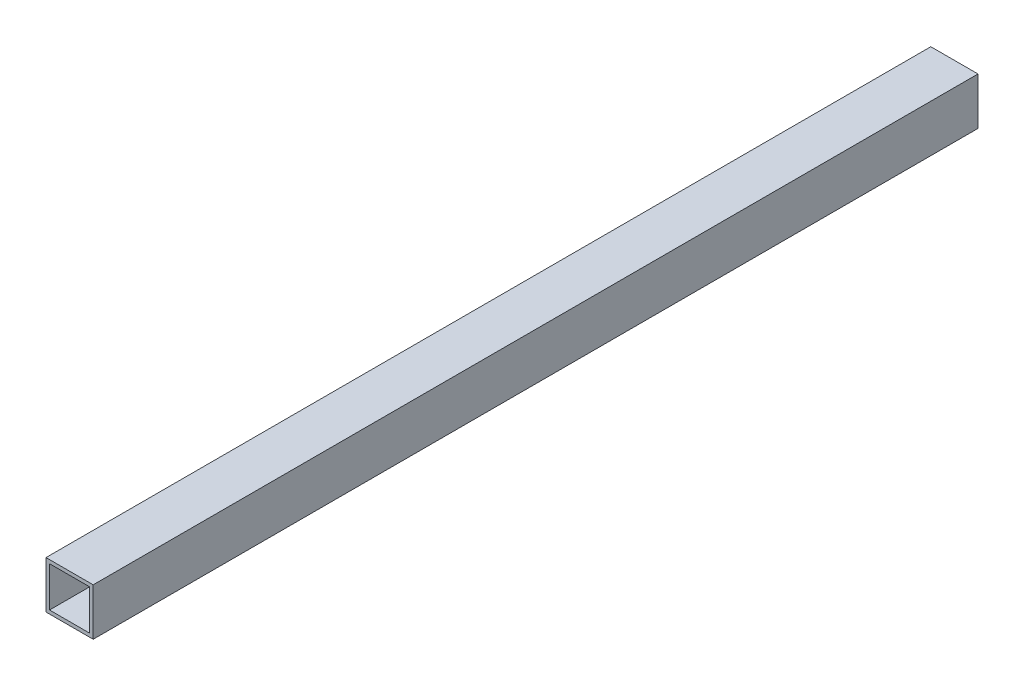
ISO-10303-21;
HEADER;
FILE_DESCRIPTION(('STEP AP214'),'2;1');
FILE_NAME('part.step','',(''),(''),'','','');
FILE_SCHEMA(('AUTOMOTIVE_DESIGN { 1 0 10303 214 1 1 1 1 }'));
ENDSEC;
DATA;
#1=APPLICATION_CONTEXT('core data for automotive mechanical design processes');
#2=APPLICATION_PROTOCOL_DEFINITION('international standard','automotive_design',2000,#1);
#3=PRODUCT_CONTEXT('',#1,'mechanical');
#4=PRODUCT('Part','Part','',(#3));
#5=PRODUCT_RELATED_PRODUCT_CATEGORY('part','',(#4));
#6=PRODUCT_DEFINITION_FORMATION('','',#4);
#7=PRODUCT_DEFINITION_CONTEXT('part definition',#1,'design');
#8=PRODUCT_DEFINITION('design','',#6,#7);
#9=PRODUCT_DEFINITION_SHAPE('','',#8);
#10=(LENGTH_UNIT() NAMED_UNIT(*) SI_UNIT(.MILLI.,.METRE.));
#11=(NAMED_UNIT(*) PLANE_ANGLE_UNIT() SI_UNIT($,.RADIAN.));
#12=(NAMED_UNIT(*) SI_UNIT($,.STERADIAN.) SOLID_ANGLE_UNIT());
#13=UNCERTAINTY_MEASURE_WITH_UNIT(LENGTH_MEASURE(1.E-05),#10,'distance_accuracy_value','');
#14=(GEOMETRIC_REPRESENTATION_CONTEXT(3) GLOBAL_UNCERTAINTY_ASSIGNED_CONTEXT((#13)) GLOBAL_UNIT_ASSIGNED_CONTEXT((#10,
#11,#12)) REPRESENTATION_CONTEXT('',''));
#15=CARTESIAN_POINT('',(0.,0.,0.));
#16=DIRECTION('',(0.,0.,1.));
#17=DIRECTION('',(1.,0.,0.));
#18=AXIS2_PLACEMENT_3D('',#15,#16,#17);
#19=CARTESIAN_POINT('',(0.,0.,750.));
#20=DIRECTION('',(0.,0.,1.));
#21=DIRECTION('',(1.,0.,0.));
#22=AXIS2_PLACEMENT_3D('',#19,#20,#21);
#23=PLANE('',#22);
#24=DIRECTION('',(0.,-1.,0.));
#25=VECTOR('',#24,1.);
#26=CARTESIAN_POINT('',(-17.,17.,750.));
#27=LINE('',#26,#25);
#28=CARTESIAN_POINT('',(-17.,17.,750.));
#29=VERTEX_POINT('',#28);
#30=CARTESIAN_POINT('',(-17.,-17.,750.));
#31=VERTEX_POINT('',#30);
#32=EDGE_CURVE('E20',#29,#31,#27,.T.);
#33=ORIENTED_EDGE('',*,*,#32,.F.);
#34=DIRECTION('',(-1.,0.,0.));
#35=VECTOR('',#34,1.);
#36=CARTESIAN_POINT('',(17.,17.,750.));
#37=LINE('',#36,#35);
#38=CARTESIAN_POINT('',(17.,17.,750.));
#39=VERTEX_POINT('',#38);
#40=EDGE_CURVE('E185',#39,#29,#37,.T.);
#41=ORIENTED_EDGE('',*,*,#40,.F.);
#42=DIRECTION('',(0.,1.,0.));
#43=VECTOR('',#42,1.);
#44=CARTESIAN_POINT('',(17.,-17.,750.));
#45=LINE('',#44,#43);
#46=CARTESIAN_POINT('',(17.,-17.,750.));
#47=VERTEX_POINT('',#46);
#48=EDGE_CURVE('E153',#47,#39,#45,.T.);
#49=ORIENTED_EDGE('',*,*,#48,.F.);
#50=DIRECTION('',(1.,0.,0.));
#51=VECTOR('',#50,1.);
#52=CARTESIAN_POINT('',(-17.,-17.,750.));
#53=LINE('',#52,#51);
#54=EDGE_CURVE('E140',#31,#47,#53,.T.);
#55=ORIENTED_EDGE('',*,*,#54,.F.);
#56=EDGE_LOOP('',(#33,#41,#49,#55));
#57=FACE_BOUND('',#56,.T.);
#58=DIRECTION('',(1.,0.,0.));
#59=VECTOR('',#58,1.);
#60=CARTESIAN_POINT('',(-20.,-20.,750.));
#61=LINE('',#60,#59);
#62=CARTESIAN_POINT('',(-20.,-20.,750.));
#63=VERTEX_POINT('',#62);
#64=CARTESIAN_POINT('',(20.,-20.,750.));
#65=VERTEX_POINT('',#64);
#66=EDGE_CURVE('E122',#63,#65,#61,.T.);
#67=ORIENTED_EDGE('',*,*,#66,.T.);
#68=DIRECTION('',(0.,1.,0.));
#69=VECTOR('',#68,1.);
#70=CARTESIAN_POINT('',(20.,-20.,750.));
#71=LINE('',#70,#69);
#72=CARTESIAN_POINT('',(20.,20.,750.));
#73=VERTEX_POINT('',#72);
#74=EDGE_CURVE('E156',#65,#73,#71,.T.);
#75=ORIENTED_EDGE('',*,*,#74,.T.);
#76=DIRECTION('',(-1.,0.,0.));
#77=VECTOR('',#76,1.);
#78=CARTESIAN_POINT('',(20.,20.,750.));
#79=LINE('',#78,#77);
#80=CARTESIAN_POINT('',(-20.,20.,750.));
#81=VERTEX_POINT('',#80);
#82=EDGE_CURVE('E114',#73,#81,#79,.T.);
#83=ORIENTED_EDGE('',*,*,#82,.T.);
#84=DIRECTION('',(0.,-1.,0.));
#85=VECTOR('',#84,1.);
#86=CARTESIAN_POINT('',(-20.,20.,750.));
#87=LINE('',#86,#85);
#88=EDGE_CURVE('E113',#81,#63,#87,.T.);
#89=ORIENTED_EDGE('',*,*,#88,.T.);
#90=EDGE_LOOP('',(#67,#75,#83,#89));
#91=FACE_BOUND('',#90,.T.);
#92=ADVANCED_FACE('F16',(#57,#91),#23,.T.);
#93=CARTESIAN_POINT('',(0.,0.,0.));
#94=DIRECTION('',(0.,0.,1.));
#95=DIRECTION('',(1.,0.,0.));
#96=AXIS2_PLACEMENT_3D('',#93,#94,#95);
#97=PLANE('',#96);
#98=DIRECTION('',(1.,0.,0.));
#99=VECTOR('',#98,1.);
#100=CARTESIAN_POINT('',(-17.,-17.,0.));
#101=LINE('',#100,#99);
#102=CARTESIAN_POINT('',(-17.,-17.,0.));
#103=VERTEX_POINT('',#102);
#104=CARTESIAN_POINT('',(17.,-17.,0.));
#105=VERTEX_POINT('',#104);
#106=EDGE_CURVE('E147',#103,#105,#101,.T.);
#107=ORIENTED_EDGE('',*,*,#106,.T.);
#108=DIRECTION('',(0.,1.,0.));
#109=VECTOR('',#108,1.);
#110=CARTESIAN_POINT('',(17.,-17.,0.));
#111=LINE('',#110,#109);
#112=CARTESIAN_POINT('',(17.,17.,0.));
#113=VERTEX_POINT('',#112);
#114=EDGE_CURVE('E181',#105,#113,#111,.T.);
#115=ORIENTED_EDGE('',*,*,#114,.T.);
#116=DIRECTION('',(-1.,0.,0.));
#117=VECTOR('',#116,1.);
#118=CARTESIAN_POINT('',(17.,17.,0.));
#119=LINE('',#118,#117);
#120=CARTESIAN_POINT('',(-17.,17.,0.));
#121=VERTEX_POINT('',#120);
#122=EDGE_CURVE('E191',#113,#121,#119,.T.);
#123=ORIENTED_EDGE('',*,*,#122,.T.);
#124=DIRECTION('',(0.,-1.,0.));
#125=VECTOR('',#124,1.);
#126=CARTESIAN_POINT('',(-17.,17.,0.));
#127=LINE('',#126,#125);
#128=EDGE_CURVE('E10',#121,#103,#127,.T.);
#129=ORIENTED_EDGE('',*,*,#128,.T.);
#130=EDGE_LOOP('',(#107,#115,#123,#129));
#131=FACE_BOUND('',#130,.T.);
#132=DIRECTION('',(0.,-1.,0.));
#133=VECTOR('',#132,1.);
#134=CARTESIAN_POINT('',(-20.,20.,0.));
#135=LINE('',#134,#133);
#136=CARTESIAN_POINT('',(-20.,20.,0.));
#137=VERTEX_POINT('',#136);
#138=CARTESIAN_POINT('',(-20.,-20.,0.));
#139=VERTEX_POINT('',#138);
#140=EDGE_CURVE('E102',#137,#139,#135,.T.);
#141=ORIENTED_EDGE('',*,*,#140,.F.);
#142=DIRECTION('',(-1.,0.,0.));
#143=VECTOR('',#142,1.);
#144=CARTESIAN_POINT('',(20.,20.,0.));
#145=LINE('',#144,#143);
#146=CARTESIAN_POINT('',(20.,20.,0.));
#147=VERTEX_POINT('',#146);
#148=EDGE_CURVE('E154',#147,#137,#145,.T.);
#149=ORIENTED_EDGE('',*,*,#148,.F.);
#150=DIRECTION('',(0.,1.,0.));
#151=VECTOR('',#150,1.);
#152=CARTESIAN_POINT('',(20.,-20.,0.));
#153=LINE('',#152,#151);
#154=CARTESIAN_POINT('',(20.,-20.,0.));
#155=VERTEX_POINT('',#154);
#156=EDGE_CURVE('E124',#155,#147,#153,.T.);
#157=ORIENTED_EDGE('',*,*,#156,.F.);
#158=DIRECTION('',(1.,0.,0.));
#159=VECTOR('',#158,1.);
#160=CARTESIAN_POINT('',(-20.,-20.,0.));
#161=LINE('',#160,#159);
#162=EDGE_CURVE('E120',#139,#155,#161,.T.);
#163=ORIENTED_EDGE('',*,*,#162,.F.);
#164=EDGE_LOOP('',(#141,#149,#157,#163));
#165=FACE_BOUND('',#164,.T.);
#166=ADVANCED_FACE('F126',(#131,#165),#97,.F.);
#167=CARTESIAN_POINT('',(-17.,17.,0.));
#168=DIRECTION('',(1.,0.,0.));
#169=DIRECTION('',(0.,1.,0.));
#170=AXIS2_PLACEMENT_3D('',#167,#168,#169);
#171=PLANE('',#170);
#172=DIRECTION('',(0.,0.,1.));
#173=VECTOR('',#172,1.);
#174=CARTESIAN_POINT('',(-17.,17.,0.));
#175=LINE('',#174,#173);
#176=EDGE_CURVE('E189',#121,#29,#175,.T.);
#177=ORIENTED_EDGE('',*,*,#176,.T.);
#178=ORIENTED_EDGE('',*,*,#32,.T.);
#179=DIRECTION('',(0.,0.,1.));
#180=VECTOR('',#179,1.);
#181=CARTESIAN_POINT('',(-17.,-17.,0.));
#182=LINE('',#181,#180);
#183=EDGE_CURVE('E139',#103,#31,#182,.T.);
#184=ORIENTED_EDGE('',*,*,#183,.F.);
#185=ORIENTED_EDGE('',*,*,#128,.F.);
#186=EDGE_LOOP('',(#177,#178,#184,#185));
#187=FACE_BOUND('',#186,.T.);
#188=ADVANCED_FACE('F18',(#187),#171,.T.);
#189=CARTESIAN_POINT('',(17.,17.,0.));
#190=DIRECTION('',(0.,-1.,0.));
#191=DIRECTION('',(0.,0.,-1.));
#192=AXIS2_PLACEMENT_3D('',#189,#190,#191);
#193=PLANE('',#192);
#194=DIRECTION('',(0.,0.,1.));
#195=VECTOR('',#194,1.);
#196=CARTESIAN_POINT('',(17.,17.,0.));
#197=LINE('',#196,#195);
#198=EDGE_CURVE('E177',#113,#39,#197,.T.);
#199=ORIENTED_EDGE('',*,*,#198,.T.);
#200=ORIENTED_EDGE('',*,*,#40,.T.);
#201=ORIENTED_EDGE('',*,*,#176,.F.);
#202=ORIENTED_EDGE('',*,*,#122,.F.);
#203=EDGE_LOOP('',(#199,#200,#201,#202));
#204=FACE_BOUND('',#203,.T.);
#205=ADVANCED_FACE('F213',(#204),#193,.T.);
#206=CARTESIAN_POINT('',(17.,-17.,0.));
#207=DIRECTION('',(-1.,0.,0.));
#208=DIRECTION('',(0.,0.,1.));
#209=AXIS2_PLACEMENT_3D('',#206,#207,#208);
#210=PLANE('',#209);
#211=DIRECTION('',(0.,0.,1.));
#212=VECTOR('',#211,1.);
#213=CARTESIAN_POINT('',(17.,-17.,0.));
#214=LINE('',#213,#212);
#215=EDGE_CURVE('E142',#105,#47,#214,.T.);
#216=ORIENTED_EDGE('',*,*,#215,.T.);
#217=ORIENTED_EDGE('',*,*,#48,.T.);
#218=ORIENTED_EDGE('',*,*,#198,.F.);
#219=ORIENTED_EDGE('',*,*,#114,.F.);
#220=EDGE_LOOP('',(#216,#217,#218,#219));
#221=FACE_BOUND('',#220,.T.);
#222=ADVANCED_FACE('F211',(#221),#210,.T.);
#223=CARTESIAN_POINT('',(-17.,-17.,0.));
#224=DIRECTION('',(0.,1.,0.));
#225=DIRECTION('',(1.,0.,0.));
#226=AXIS2_PLACEMENT_3D('',#223,#224,#225);
#227=PLANE('',#226);
#228=ORIENTED_EDGE('',*,*,#183,.T.);
#229=ORIENTED_EDGE('',*,*,#54,.T.);
#230=ORIENTED_EDGE('',*,*,#215,.F.);
#231=ORIENTED_EDGE('',*,*,#106,.F.);
#232=EDGE_LOOP('',(#228,#229,#230,#231));
#233=FACE_BOUND('',#232,.T.);
#234=ADVANCED_FACE('F204',(#233),#227,.T.);
#235=CARTESIAN_POINT('',(-20.,20.,0.));
#236=DIRECTION('',(1.,0.,0.));
#237=DIRECTION('',(0.,1.,0.));
#238=AXIS2_PLACEMENT_3D('',#235,#236,#237);
#239=PLANE('',#238);
#240=ORIENTED_EDGE('',*,*,#140,.T.);
#241=DIRECTION('',(0.,0.,1.));
#242=VECTOR('',#241,1.);
#243=CARTESIAN_POINT('',(-20.,-20.,0.));
#244=LINE('',#243,#242);
#245=EDGE_CURVE('E105',#139,#63,#244,.T.);
#246=ORIENTED_EDGE('',*,*,#245,.T.);
#247=ORIENTED_EDGE('',*,*,#88,.F.);
#248=DIRECTION('',(0.,0.,1.));
#249=VECTOR('',#248,1.);
#250=CARTESIAN_POINT('',(-20.,20.,0.));
#251=LINE('',#250,#249);
#252=EDGE_CURVE('E108',#137,#81,#251,.T.);
#253=ORIENTED_EDGE('',*,*,#252,.F.);
#254=EDGE_LOOP('',(#240,#246,#247,#253));
#255=FACE_BOUND('',#254,.T.);
#256=ADVANCED_FACE('F104',(#255),#239,.F.);
#257=CARTESIAN_POINT('',(20.,20.,0.));
#258=DIRECTION('',(0.,-1.,0.));
#259=DIRECTION('',(0.,0.,-1.));
#260=AXIS2_PLACEMENT_3D('',#257,#258,#259);
#261=PLANE('',#260);
#262=ORIENTED_EDGE('',*,*,#148,.T.);
#263=ORIENTED_EDGE('',*,*,#252,.T.);
#264=ORIENTED_EDGE('',*,*,#82,.F.);
#265=DIRECTION('',(0.,0.,1.));
#266=VECTOR('',#265,1.);
#267=CARTESIAN_POINT('',(20.,20.,0.));
#268=LINE('',#267,#266);
#269=EDGE_CURVE('E160',#147,#73,#268,.T.);
#270=ORIENTED_EDGE('',*,*,#269,.F.);
#271=EDGE_LOOP('',(#262,#263,#264,#270));
#272=FACE_BOUND('',#271,.T.);
#273=ADVANCED_FACE('F234',(#272),#261,.F.);
#274=CARTESIAN_POINT('',(20.,-20.,0.));
#275=DIRECTION('',(-1.,0.,0.));
#276=DIRECTION('',(0.,0.,1.));
#277=AXIS2_PLACEMENT_3D('',#274,#275,#276);
#278=PLANE('',#277);
#279=ORIENTED_EDGE('',*,*,#156,.T.);
#280=ORIENTED_EDGE('',*,*,#269,.T.);
#281=ORIENTED_EDGE('',*,*,#74,.F.);
#282=DIRECTION('',(0.,0.,1.));
#283=VECTOR('',#282,1.);
#284=CARTESIAN_POINT('',(20.,-20.,0.));
#285=LINE('',#284,#283);
#286=EDGE_CURVE('E130',#155,#65,#285,.T.);
#287=ORIENTED_EDGE('',*,*,#286,.F.);
#288=EDGE_LOOP('',(#279,#280,#281,#287));
#289=FACE_BOUND('',#288,.T.);
#290=ADVANCED_FACE('F238',(#289),#278,.F.);
#291=CARTESIAN_POINT('',(-20.,-20.,0.));
#292=DIRECTION('',(0.,1.,0.));
#293=DIRECTION('',(1.,0.,0.));
#294=AXIS2_PLACEMENT_3D('',#291,#292,#293);
#295=PLANE('',#294);
#296=ORIENTED_EDGE('',*,*,#162,.T.);
#297=ORIENTED_EDGE('',*,*,#286,.T.);
#298=ORIENTED_EDGE('',*,*,#66,.F.);
#299=ORIENTED_EDGE('',*,*,#245,.F.);
#300=EDGE_LOOP('',(#296,#297,#298,#299));
#301=FACE_BOUND('',#300,.T.);
#302=ADVANCED_FACE('F118',(#301),#295,.F.);
#303=CLOSED_SHELL('',(#92,#166,#188,#205,#222,#234,#256,#273,#290,#302));
#304=MANIFOLD_SOLID_BREP('B1',#303);
#305=ADVANCED_BREP_SHAPE_REPRESENTATION('',(#18,#304),#14);
#306=SHAPE_DEFINITION_REPRESENTATION(#9,#305);
ENDSEC;
END-ISO-10303-21;
